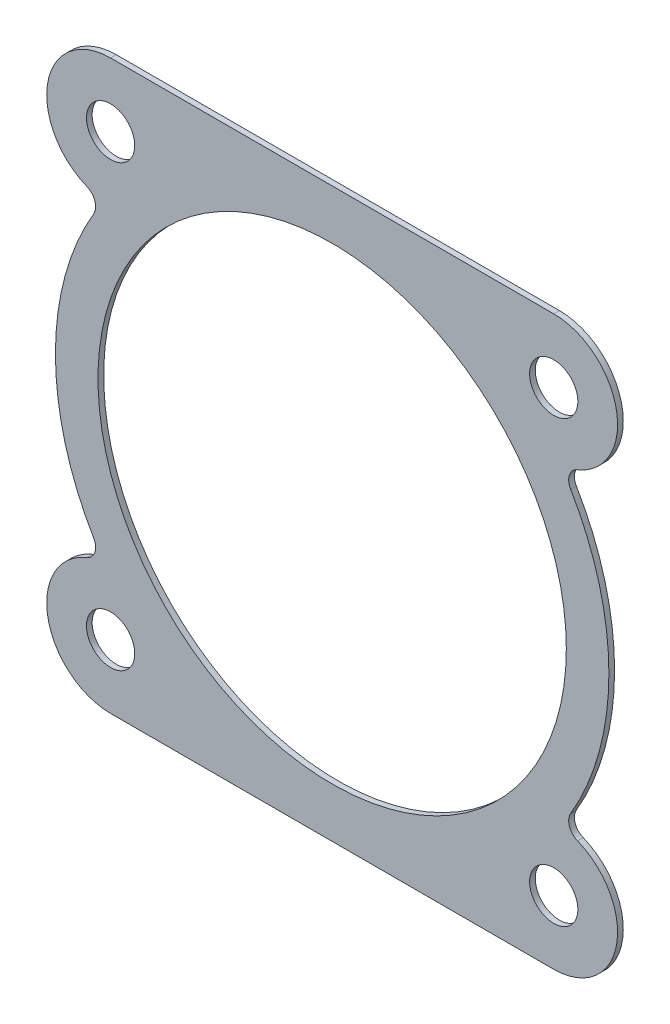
from build123d import *

# Parameters (mm, degrees)
BASE_EXTRUSION_DEPTH    = 0.2
PER_AGE1_D              = 3.4
ESQUISSE4_R             = 16.5
ENL_V_MAT_EXTRU_1_DEPTH = 29.366749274


with BuildPart() as part:
    # Esquisse1 → Base-Extrusion (new, symmetric)
    with BuildSketch(Plane.XY):
        with BuildLine():
            Line((15.612495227, 19.999999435), (-15.612495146, 20.000000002))
            ThreePointArc((-15.612495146, 20.000000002), (-20.030296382, 16.356172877), (-17.293563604, 11.325791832))
            ThreePointArc((-17.293563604, 11.325791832), (-16.720441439, 10.720328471), (-16.805322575, 9.890961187))
            ThreePointArc((-16.805322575, 9.890961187), (-19.499999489, -4.31e-07), (-16.805322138, -9.89096193))
            ThreePointArc((-16.805322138, -9.89096193), (-16.720440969, -10.720328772), (-17.293562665, -11.325791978))
            ThreePointArc((-17.293562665, -11.325791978), (-20.030295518, -16.356172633), (-15.612495, -19.999999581))
            Line((-15.612495, -19.999999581), (15.612495, -19.999999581))
            ThreePointArc((15.612495, -19.999999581), (20.030295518, -16.356172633), (17.293562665, -11.325791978))
            ThreePointArc((17.293562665, -11.325791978), (16.720440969, -10.720328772), (16.805322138, -9.89096193))
            ThreePointArc((16.805322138, -9.89096193), (19.499999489, -4.31e-07), (16.805322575, 9.890961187))
            ThreePointArc((16.805322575, 9.890961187), (16.720441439, 10.720328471), (17.293563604, 11.325791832))
            ThreePointArc((17.293563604, 11.325791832), (20.030296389, 16.356172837), (15.612495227, 19.999999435))
        make_face()
    extrude(amount=BASE_EXTRUSION_DEPTH, both=True)

    # Per_age1 (through all)
    with Locations(Plane.XY.offset(0.2)):
        with Locations((15.612495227, 15.499999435), (-15.612495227, 15.499999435), (-15.612494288, -15.499999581), (15.612494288, -15.499999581)):
            Hole(PER_AGE1_D / 2)

    # Esquisse4 → Enl_v. mat.-Extru.1 (cut, through all)
    with BuildSketch(Plane.XY.offset(0.2)):
        Circle(ESQUISSE4_R)
    extrude(amount=-ENL_V_MAT_EXTRU_1_DEPTH, mode=Mode.SUBTRACT)


solid = part.part
